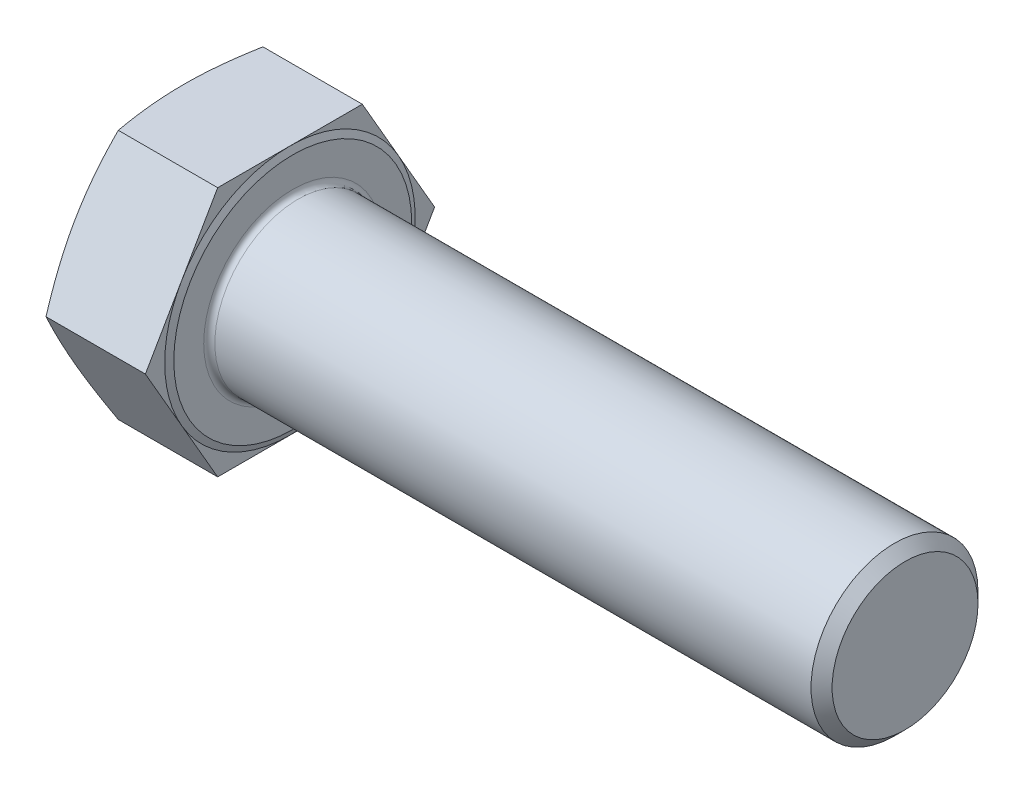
ISO-10303-21;
HEADER;
FILE_DESCRIPTION(('STEP AP214'),'2;1');
FILE_NAME('part.step','',(''),(''),'','','');
FILE_SCHEMA(('AUTOMOTIVE_DESIGN { 1 0 10303 214 1 1 1 1 }'));
ENDSEC;
DATA;
#1=APPLICATION_CONTEXT('core data for automotive mechanical design processes');
#2=APPLICATION_PROTOCOL_DEFINITION('international standard','automotive_design',2000,#1);
#3=PRODUCT_CONTEXT('',#1,'mechanical');
#4=PRODUCT('Part','Part','',(#3));
#5=PRODUCT_RELATED_PRODUCT_CATEGORY('part','',(#4));
#6=PRODUCT_DEFINITION_FORMATION('','',#4);
#7=PRODUCT_DEFINITION_CONTEXT('part definition',#1,'design');
#8=PRODUCT_DEFINITION('design','',#6,#7);
#9=PRODUCT_DEFINITION_SHAPE('','',#8);
#10=(LENGTH_UNIT() NAMED_UNIT(*) SI_UNIT(.MILLI.,.METRE.));
#11=(NAMED_UNIT(*) PLANE_ANGLE_UNIT() SI_UNIT($,.RADIAN.));
#12=(NAMED_UNIT(*) SI_UNIT($,.STERADIAN.) SOLID_ANGLE_UNIT());
#13=UNCERTAINTY_MEASURE_WITH_UNIT(LENGTH_MEASURE(1.E-05),#10,'distance_accuracy_value','');
#14=(GEOMETRIC_REPRESENTATION_CONTEXT(3) GLOBAL_UNCERTAINTY_ASSIGNED_CONTEXT((#13)) GLOBAL_UNIT_ASSIGNED_CONTEXT((#10,
#11,#12)) REPRESENTATION_CONTEXT('',''));
#15=CARTESIAN_POINT('',(0.,0.,0.));
#16=DIRECTION('',(0.,0.,1.));
#17=DIRECTION('',(1.,0.,0.));
#18=AXIS2_PLACEMENT_3D('',#15,#16,#17);
#19=CARTESIAN_POINT('',(19.62,0.,0.));
#20=DIRECTION('',(1.,0.,0.));
#21=DIRECTION('',(0.,0.,-1.));
#22=AXIS2_PLACEMENT_3D('',#19,#20,#21);
#23=PLANE('',#22);
#24=CARTESIAN_POINT('',(19.62,0.,0.));
#25=DIRECTION('',(1.,0.,0.));
#26=DIRECTION('',(0.,0.,-1.));
#27=AXIS2_PLACEMENT_3D('',#24,#25,#26);
#28=CIRCLE('',#27,16.);
#29=CARTESIAN_POINT('',(19.62,0.,-16.));
#30=VERTEX_POINT('',#29);
#31=EDGE_CURVE('E188',#30,#30,#28,.F.);
#32=ORIENTED_EDGE('',*,*,#31,.T.);
#33=EDGE_LOOP('',(#32));
#34=FACE_BOUND('',#33,.T.);
#35=CARTESIAN_POINT('',(19.62,0.,0.));
#36=DIRECTION('',(-1.,0.,0.));
#37=DIRECTION('',(0.,0.,1.));
#38=AXIS2_PLACEMENT_3D('',#35,#36,#37);
#39=CIRCLE('',#38,21.375);
#40=CARTESIAN_POINT('',(19.62,0.,21.375));
#41=VERTEX_POINT('',#40);
#42=EDGE_CURVE('E138',#41,#41,#39,.T.);
#43=ORIENTED_EDGE('',*,*,#42,.F.);
#44=EDGE_LOOP('',(#43));
#45=FACE_BOUND('',#44,.T.);
#46=ADVANCED_FACE('F33',(#34,#45),#23,.T.);
#47=CARTESIAN_POINT('',(19.12,-45.,0.));
#48=DIRECTION('',(-1.,0.,0.));
#49=DIRECTION('',(0.,0.,1.));
#50=AXIS2_PLACEMENT_3D('',#47,#48,#49);
#51=PLANE('',#50);
#52=DIRECTION('',(0.,-0.866025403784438,0.5));
#53=VECTOR('',#52,1.);
#54=CARTESIAN_POINT('',(19.12,22.5,12.9903810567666));
#55=LINE('',#54,#53);
#56=CARTESIAN_POINT('',(19.12,22.5,12.9903810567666));
#57=VERTEX_POINT('',#56);
#58=CARTESIAN_POINT('',(19.12,11.25,19.4855715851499));
#59=VERTEX_POINT('',#58);
#60=EDGE_CURVE('E137',#57,#59,#55,.T.);
#61=ORIENTED_EDGE('',*,*,#60,.T.);
#62=CARTESIAN_POINT('',(19.12,0.,0.));
#63=DIRECTION('',(-1.,0.,0.));
#64=DIRECTION('',(0.,0.,1.));
#65=AXIS2_PLACEMENT_3D('',#62,#63,#64);
#66=CIRCLE('',#65,22.5);
#67=CARTESIAN_POINT('',(19.12,22.5,0.));
#68=VERTEX_POINT('',#67);
#69=EDGE_CURVE('E49',#59,#68,#66,.T.);
#70=ORIENTED_EDGE('',*,*,#69,.T.);
#71=DIRECTION('',(0.,0.,1.));
#72=VECTOR('',#71,1.);
#73=CARTESIAN_POINT('',(19.12,22.5,-12.9903810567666));
#74=LINE('',#73,#72);
#75=EDGE_CURVE('E134',#68,#57,#74,.T.);
#76=ORIENTED_EDGE('',*,*,#75,.T.);
#77=EDGE_LOOP('',(#61,#70,#76));
#78=FACE_BOUND('',#77,.T.);
#79=ADVANCED_FACE('F133',(#78),#51,.F.);
#80=CARTESIAN_POINT('',(19.12,22.5,-12.9903810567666));
#81=VERTEX_POINT('',#80);
#82=EDGE_CURVE('E145',#81,#68,#74,.T.);
#83=ORIENTED_EDGE('',*,*,#82,.T.);
#84=CARTESIAN_POINT('',(19.12,11.25,-19.4855715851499));
#85=VERTEX_POINT('',#84);
#86=EDGE_CURVE('E121',#68,#85,#66,.T.);
#87=ORIENTED_EDGE('',*,*,#86,.T.);
#88=DIRECTION('',(0.,0.866025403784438,0.5));
#89=VECTOR('',#88,1.);
#90=CARTESIAN_POINT('',(19.12,0.,-25.9807621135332));
#91=LINE('',#90,#89);
#92=EDGE_CURVE('E151',#85,#81,#91,.T.);
#93=ORIENTED_EDGE('',*,*,#92,.T.);
#94=EDGE_LOOP('',(#83,#87,#93));
#95=FACE_BOUND('',#94,.T.);
#96=ADVANCED_FACE('F150',(#95),#51,.F.);
#97=CARTESIAN_POINT('',(19.12,0.,-25.9807621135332));
#98=VERTEX_POINT('',#97);
#99=EDGE_CURVE('E148',#98,#85,#91,.T.);
#100=ORIENTED_EDGE('',*,*,#99,.T.);
#101=CARTESIAN_POINT('',(19.12,-11.25,-19.4855715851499));
#102=VERTEX_POINT('',#101);
#103=EDGE_CURVE('E124',#85,#102,#66,.T.);
#104=ORIENTED_EDGE('',*,*,#103,.T.);
#105=DIRECTION('',(0.,0.866025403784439,-0.5));
#106=VECTOR('',#105,1.);
#107=CARTESIAN_POINT('',(19.12,-22.5,-12.9903810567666));
#108=LINE('',#107,#106);
#109=EDGE_CURVE('E348',#102,#98,#108,.T.);
#110=ORIENTED_EDGE('',*,*,#109,.T.);
#111=EDGE_LOOP('',(#100,#104,#110));
#112=FACE_BOUND('',#111,.T.);
#113=ADVANCED_FACE('F302',(#112),#51,.F.);
#114=CARTESIAN_POINT('',(19.12,-22.5,-12.9903810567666));
#115=VERTEX_POINT('',#114);
#116=EDGE_CURVE('E316',#115,#102,#108,.T.);
#117=ORIENTED_EDGE('',*,*,#116,.T.);
#118=CARTESIAN_POINT('',(19.12,-22.5,0.));
#119=VERTEX_POINT('',#118);
#120=EDGE_CURVE('E317',#102,#119,#66,.T.);
#121=ORIENTED_EDGE('',*,*,#120,.T.);
#122=DIRECTION('',(0.,0.,-1.));
#123=VECTOR('',#122,1.);
#124=CARTESIAN_POINT('',(19.12,-22.5,12.9903810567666));
#125=LINE('',#124,#123);
#126=EDGE_CURVE('E162',#119,#115,#125,.T.);
#127=ORIENTED_EDGE('',*,*,#126,.T.);
#128=EDGE_LOOP('',(#117,#121,#127));
#129=FACE_BOUND('',#128,.T.);
#130=ADVANCED_FACE('F295',(#129),#51,.F.);
#131=CARTESIAN_POINT('',(19.12,-22.5,12.9903810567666));
#132=VERTEX_POINT('',#131);
#133=EDGE_CURVE('E163',#132,#119,#125,.T.);
#134=ORIENTED_EDGE('',*,*,#133,.T.);
#135=CARTESIAN_POINT('',(19.12,-11.25,19.4855715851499));
#136=VERTEX_POINT('',#135);
#137=EDGE_CURVE('E306',#119,#136,#66,.T.);
#138=ORIENTED_EDGE('',*,*,#137,.T.);
#139=DIRECTION('',(0.,-0.866025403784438,-0.5));
#140=VECTOR('',#139,1.);
#141=CARTESIAN_POINT('',(19.12,0.,25.9807621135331));
#142=LINE('',#141,#140);
#143=EDGE_CURVE('E158',#136,#132,#142,.T.);
#144=ORIENTED_EDGE('',*,*,#143,.T.);
#145=EDGE_LOOP('',(#134,#138,#144));
#146=FACE_BOUND('',#145,.T.);
#147=ADVANCED_FACE('F287',(#146),#51,.F.);
#148=CARTESIAN_POINT('',(19.12,-22.5,-12.9903810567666));
#149=DIRECTION('',(0.,0.5,0.866025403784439));
#150=DIRECTION('',(0.,-0.866025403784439,0.5));
#151=AXIS2_PLACEMENT_3D('',#148,#149,#150);
#152=PLANE('',#151);
#153=CARTESIAN_POINT('',(1.2669358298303,0.00020000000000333,-25.980877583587));
#154=CARTESIAN_POINT('',(1.16902690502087,-0.465760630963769,-25.7118550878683));
#155=CARTESIAN_POINT('',(1.07552121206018,-0.932406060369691,-25.4424372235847));
#156=CARTESIAN_POINT('',(0.898284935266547,-1.86713009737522,-24.9027740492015));
#157=CARTESIAN_POINT('',(0.814555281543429,-2.33520883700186,-24.6325286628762));
#158=CARTESIAN_POINT('',(0.579402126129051,-3.74220534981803,-23.8201988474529));
#159=CARTESIAN_POINT('',(0.444152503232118,-4.68323927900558,-23.2768926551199));
#160=CARTESIAN_POINT('',(0.279780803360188,-6.09360926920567,-22.4626151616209));
#161=CARTESIAN_POINT('',(0.231546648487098,-6.56131811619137,-22.1925833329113));
#162=CARTESIAN_POINT('',(0.148249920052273,-7.49760906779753,-21.6520154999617));
#163=CARTESIAN_POINT('',(0.113186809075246,-7.96619113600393,-21.3814795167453));
#164=CARTESIAN_POINT('',(0.0568446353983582,-8.90381667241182,-20.8401411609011));
#165=CARTESIAN_POINT('',(0.035560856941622,-9.37285992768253,-20.569338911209));
#166=CARTESIAN_POINT('',(0.00713856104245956,-10.3112687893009,-20.0275483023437));
#167=CARTESIAN_POINT('',(0.,-10.7806343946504,-19.7565599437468));
#168=CARTESIAN_POINT('',(0.,-11.7193656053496,-19.214583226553));
#169=CARTESIAN_POINT('',(0.00713856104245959,-12.1887312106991,-18.943594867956));
#170=CARTESIAN_POINT('',(0.0355608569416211,-13.1271400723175,-18.4018042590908));
#171=CARTESIAN_POINT('',(0.0568446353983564,-13.5961833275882,-18.1310020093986));
#172=CARTESIAN_POINT('',(0.113186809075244,-14.5338088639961,-17.5896636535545));
#173=CARTESIAN_POINT('',(0.148249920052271,-15.0023909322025,-17.3191276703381));
#174=CARTESIAN_POINT('',(0.231546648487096,-15.9386818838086,-16.7785598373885));
#175=CARTESIAN_POINT('',(0.279780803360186,-16.4063907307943,-16.5085280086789));
#176=CARTESIAN_POINT('',(0.444152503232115,-17.8167607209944,-15.6942505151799));
#177=CARTESIAN_POINT('',(0.579402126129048,-18.757794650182,-15.1509443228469));
#178=CARTESIAN_POINT('',(0.814555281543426,-20.1647911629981,-14.3386145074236));
#179=CARTESIAN_POINT('',(0.898284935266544,-20.6328699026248,-14.0683691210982));
#180=CARTESIAN_POINT('',(1.07552121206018,-21.5675939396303,-13.5287059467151));
#181=CARTESIAN_POINT('',(1.16902690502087,-22.0342393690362,-13.2592880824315));
#182=CARTESIAN_POINT('',(1.26693582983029,-22.5002,-12.9902655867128));
#183=B_SPLINE_CURVE_WITH_KNOTS('',3,(#153,#154,#155,#156,#157,#158,#159,#160,#161,#162,#163,
#164,#165,#166,#167,#168,#169,#170,#171,#172,#173,#174,#175,#176,#177,#178,#179,#180,#181,#182),
.UNSPECIFIED.,.F.,.F.,(4,2,2,2,2,2,2,2,2,2,2,2,2,2,4),(0.,1.64059355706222,3.28134307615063,
6.56511024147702,8.19162193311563,9.81806725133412,11.4439556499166,13.0698390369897,
14.6957224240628,16.3216108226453,17.9480561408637,19.5745678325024,22.8583349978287,
24.4990845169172,26.1396780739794),.UNSPECIFIED.);
#184=CARTESIAN_POINT('',(1.26689380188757,0.,-25.9807621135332));
#185=VERTEX_POINT('',#184);
#186=CARTESIAN_POINT('',(0.,-11.25,-19.4855715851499));
#187=VERTEX_POINT('',#186);
#188=EDGE_CURVE('E332',#185,#187,#183,.T.);
#189=ORIENTED_EDGE('',*,*,#188,.F.);
#190=DIRECTION('',(-1.,0.,0.));
#191=VECTOR('',#190,1.);
#192=CARTESIAN_POINT('',(19.12,0.,-25.9807621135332));
#193=LINE('',#192,#191);
#194=EDGE_CURVE('E178',#98,#185,#193,.T.);
#195=ORIENTED_EDGE('',*,*,#194,.F.);
#196=ORIENTED_EDGE('',*,*,#109,.F.);
#197=ORIENTED_EDGE('',*,*,#116,.F.);
#198=DIRECTION('',(-1.,0.,0.));
#199=VECTOR('',#198,1.);
#200=CARTESIAN_POINT('',(19.12,-22.5,-12.9903810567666));
#201=LINE('',#200,#199);
#202=CARTESIAN_POINT('',(1.26689380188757,-22.5,-12.9903810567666));
#203=VERTEX_POINT('',#202);
#204=EDGE_CURVE('E166',#115,#203,#201,.T.);
#205=ORIENTED_EDGE('',*,*,#204,.T.);
#206=EDGE_CURVE('E245',#187,#203,#183,.T.);
#207=ORIENTED_EDGE('',*,*,#206,.F.);
#208=EDGE_LOOP('',(#189,#195,#196,#197,#205,#207));
#209=FACE_BOUND('',#208,.T.);
#210=ADVANCED_FACE('F35',(#209),#152,.F.);
#211=CARTESIAN_POINT('',(19.12,0.,-25.9807621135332));
#212=DIRECTION('',(0.,-0.5,0.866025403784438));
#213=DIRECTION('',(0.,-0.866025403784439,-0.5));
#214=AXIS2_PLACEMENT_3D('',#211,#212,#213);
#215=PLANE('',#214);
#216=CARTESIAN_POINT('',(1.26693582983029,22.5002,-12.9902655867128));
#217=CARTESIAN_POINT('',(1.16902690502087,22.0342393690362,-13.2592880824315));
#218=CARTESIAN_POINT('',(1.07552121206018,21.5675939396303,-13.5287059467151));
#219=CARTESIAN_POINT('',(0.898284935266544,20.6328699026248,-14.0683691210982));
#220=CARTESIAN_POINT('',(0.814555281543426,20.1647911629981,-14.3386145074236));
#221=CARTESIAN_POINT('',(0.579402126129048,18.757794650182,-15.1509443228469));
#222=CARTESIAN_POINT('',(0.444152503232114,17.8167607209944,-15.6942505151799));
#223=CARTESIAN_POINT('',(0.279780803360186,16.4063907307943,-16.5085280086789));
#224=CARTESIAN_POINT('',(0.231546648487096,15.9386818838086,-16.7785598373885));
#225=CARTESIAN_POINT('',(0.148249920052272,15.0023909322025,-17.3191276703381));
#226=CARTESIAN_POINT('',(0.113186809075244,14.5338088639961,-17.5896636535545));
#227=CARTESIAN_POINT('',(0.0568446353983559,13.5961833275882,-18.1310020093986));
#228=CARTESIAN_POINT('',(0.0355608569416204,13.1271400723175,-18.4018042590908));
#229=CARTESIAN_POINT('',(0.00713856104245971,12.1887312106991,-18.943594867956));
#230=CARTESIAN_POINT('',(0.,11.7193656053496,-19.214583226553));
#231=CARTESIAN_POINT('',(0.,10.7806343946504,-19.7565599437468));
#232=CARTESIAN_POINT('',(0.00713856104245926,10.3112687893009,-20.0275483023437));
#233=CARTESIAN_POINT('',(0.0355608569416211,9.37285992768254,-20.569338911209));
#234=CARTESIAN_POINT('',(0.056844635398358,8.90381667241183,-20.8401411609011));
#235=CARTESIAN_POINT('',(0.113186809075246,7.96619113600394,-21.3814795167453));
#236=CARTESIAN_POINT('',(0.148249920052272,7.49760906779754,-21.6520154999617));
#237=CARTESIAN_POINT('',(0.231546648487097,6.56131811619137,-22.1925833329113));
#238=CARTESIAN_POINT('',(0.279780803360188,6.09360926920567,-22.4626151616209));
#239=CARTESIAN_POINT('',(0.444152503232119,4.68323927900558,-23.2768926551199));
#240=CARTESIAN_POINT('',(0.579402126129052,3.74220534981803,-23.8201988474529));
#241=CARTESIAN_POINT('',(0.81455528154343,2.33520883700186,-24.6325286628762));
#242=CARTESIAN_POINT('',(0.898284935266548,1.86713009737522,-24.9027740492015));
#243=CARTESIAN_POINT('',(1.07552121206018,0.932406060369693,-25.4424372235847));
#244=CARTESIAN_POINT('',(1.16902690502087,0.465760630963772,-25.7118550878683));
#245=CARTESIAN_POINT('',(1.2669358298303,-0.000199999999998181,-25.980877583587));
#246=B_SPLINE_CURVE_WITH_KNOTS('',3,(#216,#217,#218,#219,#220,#221,#222,#223,#224,#225,#226,
#227,#228,#229,#230,#231,#232,#233,#234,#235,#236,#237,#238,#239,#240,#241,#242,#243,#244,#245),
.UNSPECIFIED.,.F.,.F.,(4,2,2,2,2,2,2,2,2,2,2,2,2,2,4),(0.,1.64059355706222,3.28134307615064,
6.56511024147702,8.19162193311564,9.81806725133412,11.4439556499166,13.0698390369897,
14.6957224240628,16.3216108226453,17.9480561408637,19.5745678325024,22.8583349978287,
24.4990845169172,26.1396780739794),.UNSPECIFIED.);
#247=CARTESIAN_POINT('',(1.26689380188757,22.5,-12.9903810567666));
#248=VERTEX_POINT('',#247);
#249=CARTESIAN_POINT('',(0.,11.25,-19.4855715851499));
#250=VERTEX_POINT('',#249);
#251=EDGE_CURVE('E260',#248,#250,#246,.T.);
#252=ORIENTED_EDGE('',*,*,#251,.F.);
#253=DIRECTION('',(-1.,0.,0.));
#254=VECTOR('',#253,1.);
#255=CARTESIAN_POINT('',(19.12,22.5,-12.9903810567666));
#256=LINE('',#255,#254);
#257=EDGE_CURVE('E176',#81,#248,#256,.T.);
#258=ORIENTED_EDGE('',*,*,#257,.F.);
#259=ORIENTED_EDGE('',*,*,#92,.F.);
#260=ORIENTED_EDGE('',*,*,#99,.F.);
#261=ORIENTED_EDGE('',*,*,#194,.T.);
#262=EDGE_CURVE('E256',#250,#185,#246,.T.);
#263=ORIENTED_EDGE('',*,*,#262,.F.);
#264=EDGE_LOOP('',(#252,#258,#259,#260,#261,#263));
#265=FACE_BOUND('',#264,.T.);
#266=ADVANCED_FACE('F266',(#265),#215,.F.);
#267=CARTESIAN_POINT('',(19.12,22.5,-12.9903810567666));
#268=DIRECTION('',(0.,-1.,0.));
#269=DIRECTION('',(0.,0.,-1.));
#270=AXIS2_PLACEMENT_3D('',#267,#268,#269);
#271=PLANE('',#270);
#272=CARTESIAN_POINT('',(6.7697780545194,22.5,-34.3939613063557));
#273=CARTESIAN_POINT('',(6.6147526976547,22.5,-33.8849780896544));
#274=CARTESIAN_POINT('',(6.46066486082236,22.5,-33.3757094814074));
#275=CARTESIAN_POINT('',(6.15457411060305,22.5,-32.3565430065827));
#276=CARTESIAN_POINT('',(6.00257120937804,22.5,-31.8466451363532));
#277=CARTESIAN_POINT('',(5.5499851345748,22.5,-30.3158533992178));
#278=CARTESIAN_POINT('',(5.2528475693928,22.5,-29.2939366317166));
#279=CARTESIAN_POINT('',(4.66933339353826,22.5,-27.244966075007));
#280=CARTESIAN_POINT('',(4.3829778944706,22.5,-26.2179062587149));
#281=CARTESIAN_POINT('',(3.82435576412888,22.5,-24.1599665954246));
#282=CARTESIAN_POINT('',(3.55208887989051,22.5,-23.1290868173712));
#283=CARTESIAN_POINT('',(3.02838958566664,22.5,-21.075558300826));
#284=CARTESIAN_POINT('',(2.77674168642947,22.5,-20.0529647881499));
#285=CARTESIAN_POINT('',(2.29487034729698,22.5,-18.0026892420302));
#286=CARTESIAN_POINT('',(2.06464726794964,22.5,-16.9750071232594));
#287=CARTESIAN_POINT('',(1.63099346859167,22.5,-14.9143243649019));
#288=CARTESIAN_POINT('',(1.4275536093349,22.5,-13.8813256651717));
#289=CARTESIAN_POINT('',(1.05366080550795,22.5,-11.8093309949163));
#290=CARTESIAN_POINT('',(0.883206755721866,22.5,-10.7703352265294));
#291=CARTESIAN_POINT('',(0.599087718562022,22.5,-8.80334142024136));
#292=CARTESIAN_POINT('',(0.481198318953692,22.5,-7.87595930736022));
#293=CARTESIAN_POINT('',(0.281639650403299,22.5,-6.01727365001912));
#294=CARTESIAN_POINT('',(0.199969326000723,22.5,-5.0859702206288));
#295=CARTESIAN_POINT('',(0.0767818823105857,22.5,-3.22133095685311));
#296=CARTESIAN_POINT('',(0.0352363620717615,22.5,-2.28799702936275));
#297=CARTESIAN_POINT('',(-0.00559802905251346,22.5,-0.420395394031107));
#298=CARTESIAN_POINT('',(-0.00488719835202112,22.5,0.513872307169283));
#299=CARTESIAN_POINT('',(0.0388631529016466,22.5,2.38614034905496));
#300=CARTESIAN_POINT('',(0.0821173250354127,22.5,3.32413559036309));
#301=CARTESIAN_POINT('',(0.208963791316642,22.5,5.19737094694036));
#302=CARTESIAN_POINT('',(0.292557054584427,22.5,6.13261099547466));
#303=CARTESIAN_POINT('',(0.496171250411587,22.5,7.99987415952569));
#304=CARTESIAN_POINT('',(0.616223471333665,22.5,8.93189381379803));
#305=CARTESIAN_POINT('',(0.887885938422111,22.5,10.791270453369));
#306=CARTESIAN_POINT('',(1.03949635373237,22.5,11.7186274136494));
#307=CARTESIAN_POINT('',(1.37806511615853,22.5,13.6174776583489));
#308=CARTESIAN_POINT('',(1.56646900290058,22.5,14.5887109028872));
#309=CARTESIAN_POINT('',(1.96752546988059,22.5,16.5261898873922));
#310=CARTESIAN_POINT('',(2.18017987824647,22.5,17.4924352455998));
#311=CARTESIAN_POINT('',(2.62527208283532,22.5,19.42062699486));
#312=CARTESIAN_POINT('',(2.85771562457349,22.5,20.3825720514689));
#313=CARTESIAN_POINT('',(3.33860492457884,22.5,22.3024099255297));
#314=CARTESIAN_POINT('',(3.58705029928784,22.5,23.2603028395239));
#315=CARTESIAN_POINT('',(4.09727957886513,22.5,25.1738346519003));
#316=CARTESIAN_POINT('',(4.35908020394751,22.5,26.1294690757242));
#317=CARTESIAN_POINT('',(4.89333122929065,22.5,28.0377523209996));
#318=CARTESIAN_POINT('',(5.16578167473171,22.5,28.9904011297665));
#319=CARTESIAN_POINT('',(5.71938307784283,22.5,30.8929884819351));
#320=CARTESIAN_POINT('',(6.00053256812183,22.5,31.8429274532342));
#321=CARTESIAN_POINT('',(6.57006413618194,22.5,33.7406289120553));
#322=CARTESIAN_POINT('',(6.85844619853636,22.5,34.6883914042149));
#323=CARTESIAN_POINT('',(7.43802103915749,22.5,36.5716051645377));
#324=CARTESIAN_POINT('',(7.72914763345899,22.5,37.5070768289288));
#325=CARTESIAN_POINT('',(8.31635992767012,22.5,39.3764609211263));
#326=CARTESIAN_POINT('',(8.61244562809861,22.5,40.3103733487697));
#327=CARTESIAN_POINT('',(9.20883136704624,22.5,42.1768976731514));
#328=CARTESIAN_POINT('',(9.50913159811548,22.5,43.1095095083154));
#329=CARTESIAN_POINT('',(10.1133153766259,22.5,44.9735719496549));
#330=CARTESIAN_POINT('',(10.4171989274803,22.5,45.9050225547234));
#331=CARTESIAN_POINT('',(11.0268823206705,22.5,47.763380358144));
#332=CARTESIAN_POINT('',(11.3326705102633,22.5,48.6902913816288));
#333=CARTESIAN_POINT('',(11.9468856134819,22.5,50.5432389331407));
#334=CARTESIAN_POINT('',(12.2553125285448,22.5,51.4692754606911));
#335=CARTESIAN_POINT('',(12.8744319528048,22.5,53.3205062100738));
#336=CARTESIAN_POINT('',(13.185124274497,22.5,54.2457004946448));
#337=CARTESIAN_POINT('',(13.8085193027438,22.5,56.0954091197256));
#338=CARTESIAN_POINT('',(14.121222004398,22.5,57.0199234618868));
#339=CARTESIAN_POINT('',(14.4347905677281,22.5,57.9441433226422));
#340=B_SPLINE_CURVE_WITH_KNOTS('',3,(#272,#273,#274,#275,#276,#277,#278,#279,#280,#281,#282,
#283,#284,#285,#286,#287,#288,#289,#290,#291,#292,#293,#294,#295,#296,#297,#298,#299,#300,#301,
#302,#303,#304,#305,#306,#307,#308,#309,#310,#311,#312,#313,#314,#315,#316,#317,#318,#319,#320,
#321,#322,#323,#324,#325,#326,#327,#328,#329,#330,#331,#332,#333,#334,#335,#336,#337,#338,#339),
.UNSPECIFIED.,.F.,.F.,(4,2,2,2,2,2,2,2,2,2,2,2,2,2,2,2,2,2,2,2,2,2,2,2,2,2,2,2,2,2,2,2,2,4),(0.,
1.59620348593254,3.19241627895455,6.3850778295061,9.58369609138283,12.7822569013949,
15.9413811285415,19.100558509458,22.2586550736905,25.4166458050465,28.2205656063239,
31.02440369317,33.8262557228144,36.6280879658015,39.444129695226,42.2602390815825,
45.0787720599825,47.8973201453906,50.8649551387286,53.8328139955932,56.8015374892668,
59.7701898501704,62.7426546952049,65.7151321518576,68.6871109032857,71.6590833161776,
74.5982434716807,77.5374039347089,80.4766991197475,83.4159971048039,86.3441377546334,
89.2722799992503,92.2001825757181,95.1280780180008),.UNSPECIFIED.);
#341=CARTESIAN_POINT('',(1.26689380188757,22.5000000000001,12.9903810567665));
#342=VERTEX_POINT('',#341);
#343=CARTESIAN_POINT('',(0.,22.5,0.));
#344=VERTEX_POINT('',#343);
#345=EDGE_CURVE('E349',#342,#344,#340,.F.);
#346=ORIENTED_EDGE('',*,*,#345,.F.);
#347=DIRECTION('',(-1.,0.,0.));
#348=VECTOR('',#347,1.);
#349=CARTESIAN_POINT('',(19.12,22.5,12.9903810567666));
#350=LINE('',#349,#348);
#351=EDGE_CURVE('E147',#57,#342,#350,.T.);
#352=ORIENTED_EDGE('',*,*,#351,.F.);
#353=ORIENTED_EDGE('',*,*,#75,.F.);
#354=ORIENTED_EDGE('',*,*,#82,.F.);
#355=ORIENTED_EDGE('',*,*,#257,.T.);
#356=EDGE_CURVE('E261',#344,#248,#340,.F.);
#357=ORIENTED_EDGE('',*,*,#356,.F.);
#358=EDGE_LOOP('',(#346,#352,#353,#354,#355,#357));
#359=FACE_BOUND('',#358,.T.);
#360=ADVANCED_FACE('F143',(#359),#271,.F.);
#361=CARTESIAN_POINT('',(19.12,22.5,12.9903810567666));
#362=DIRECTION('',(0.,-0.5,-0.866025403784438));
#363=DIRECTION('',(0.,0.866025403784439,-0.5));
#364=AXIS2_PLACEMENT_3D('',#361,#362,#363);
#365=PLANE('',#364);
#366=CARTESIAN_POINT('',(1.26693582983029,-0.000199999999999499,25.980877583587));
#367=CARTESIAN_POINT('',(1.16902690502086,0.46576063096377,25.7118550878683));
#368=CARTESIAN_POINT('',(1.07552121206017,0.932406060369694,25.4424372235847));
#369=CARTESIAN_POINT('',(0.898284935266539,1.86713009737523,24.9027740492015));
#370=CARTESIAN_POINT('',(0.81455528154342,2.33520883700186,24.6325286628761));
#371=CARTESIAN_POINT('',(0.579402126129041,3.74220534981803,23.8201988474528));
#372=CARTESIAN_POINT('',(0.444152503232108,4.68323927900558,23.2768926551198));
#373=CARTESIAN_POINT('',(0.279780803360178,6.09360926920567,22.4626151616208));
#374=CARTESIAN_POINT('',(0.231546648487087,6.56131811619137,22.1925833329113));
#375=CARTESIAN_POINT('',(0.148249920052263,7.49760906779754,21.6520154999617));
#376=CARTESIAN_POINT('',(0.113186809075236,7.96619113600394,21.3814795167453));
#377=CARTESIAN_POINT('',(0.0568446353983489,8.90381667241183,20.8401411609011));
#378=CARTESIAN_POINT('',(0.0355608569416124,9.37285992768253,20.569338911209));
#379=CARTESIAN_POINT('',(0.00713856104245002,10.3112687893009,20.0275483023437));
#380=CARTESIAN_POINT('',(0.,10.7806343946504,19.7565599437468));
#381=CARTESIAN_POINT('',(0.,11.7193656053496,19.2145832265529));
#382=CARTESIAN_POINT('',(0.00713856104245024,12.1887312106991,18.943594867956));
#383=CARTESIAN_POINT('',(0.0355608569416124,13.1271400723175,18.4018042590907));
#384=CARTESIAN_POINT('',(0.0568446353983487,13.5961833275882,18.1310020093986));
#385=CARTESIAN_POINT('',(0.113186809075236,14.5338088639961,17.5896636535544));
#386=CARTESIAN_POINT('',(0.148249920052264,15.0023909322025,17.319127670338));
#387=CARTESIAN_POINT('',(0.231546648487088,15.9386818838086,16.7785598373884));
#388=CARTESIAN_POINT('',(0.279780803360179,16.4063907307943,16.5085280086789));
#389=CARTESIAN_POINT('',(0.44415250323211,17.8167607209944,15.6942505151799));
#390=CARTESIAN_POINT('',(0.579402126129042,18.757794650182,15.1509443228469));
#391=CARTESIAN_POINT('',(0.814555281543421,20.1647911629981,14.3386145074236));
#392=CARTESIAN_POINT('',(0.89828493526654,20.6328699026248,14.0683691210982));
#393=CARTESIAN_POINT('',(1.07552121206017,21.5675939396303,13.528705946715));
#394=CARTESIAN_POINT('',(1.16902690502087,22.0342393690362,13.2592880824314));
#395=CARTESIAN_POINT('',(1.26693582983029,22.5002,12.9902655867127));
#396=B_SPLINE_CURVE_WITH_KNOTS('',3,(#366,#367,#368,#369,#370,#371,#372,#373,#374,#375,#376,
#377,#378,#379,#380,#381,#382,#383,#384,#385,#386,#387,#388,#389,#390,#391,#392,#393,#394,#395),
.UNSPECIFIED.,.F.,.F.,(4,2,2,2,2,2,2,2,2,2,2,2,2,2,4),(0.,1.64059355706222,3.28134307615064,
6.56511024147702,8.19162193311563,9.81806725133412,11.4439556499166,13.0698390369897,
14.6957224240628,16.3216108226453,17.9480561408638,19.5745678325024,22.8583349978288,
24.4990845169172,26.1396780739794),.UNSPECIFIED.);
#397=CARTESIAN_POINT('',(1.26689380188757,0.,25.9807621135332));
#398=VERTEX_POINT('',#397);
#399=CARTESIAN_POINT('',(0.,11.25,19.4855715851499));
#400=VERTEX_POINT('',#399);
#401=EDGE_CURVE('E250',#398,#400,#396,.T.);
#402=ORIENTED_EDGE('',*,*,#401,.F.);
#403=DIRECTION('',(-1.,0.,0.));
#404=VECTOR('',#403,1.);
#405=CARTESIAN_POINT('',(19.12,0.,25.9807621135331));
#406=LINE('',#405,#404);
#407=CARTESIAN_POINT('',(19.12,0.,25.9807621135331));
#408=VERTEX_POINT('',#407);
#409=EDGE_CURVE('E172',#408,#398,#406,.T.);
#410=ORIENTED_EDGE('',*,*,#409,.F.);
#411=EDGE_CURVE('E153',#59,#408,#55,.T.);
#412=ORIENTED_EDGE('',*,*,#411,.F.);
#413=ORIENTED_EDGE('',*,*,#60,.F.);
#414=ORIENTED_EDGE('',*,*,#351,.T.);
#415=EDGE_CURVE('E335',#400,#342,#396,.T.);
#416=ORIENTED_EDGE('',*,*,#415,.F.);
#417=EDGE_LOOP('',(#402,#410,#412,#413,#414,#416));
#418=FACE_BOUND('',#417,.T.);
#419=ADVANCED_FACE('F272',(#418),#365,.F.);
#420=CARTESIAN_POINT('',(19.12,0.,25.9807621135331));
#421=DIRECTION('',(0.,0.5,-0.866025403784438));
#422=DIRECTION('',(0.,0.866025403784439,0.5));
#423=AXIS2_PLACEMENT_3D('',#420,#421,#422);
#424=PLANE('',#423);
#425=CARTESIAN_POINT('',(1.26693582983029,-22.5002,12.9902655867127));
#426=CARTESIAN_POINT('',(1.16902690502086,-22.0342393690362,13.2592880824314));
#427=CARTESIAN_POINT('',(1.07552121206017,-21.5675939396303,13.528705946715));
#428=CARTESIAN_POINT('',(0.898284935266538,-20.6328699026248,14.0683691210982));
#429=CARTESIAN_POINT('',(0.814555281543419,-20.1647911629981,14.3386145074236));
#430=CARTESIAN_POINT('',(0.579402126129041,-18.757794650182,15.1509443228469));
#431=CARTESIAN_POINT('',(0.444152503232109,-17.8167607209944,15.6942505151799));
#432=CARTESIAN_POINT('',(0.279780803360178,-16.4063907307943,16.5085280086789));
#433=CARTESIAN_POINT('',(0.231546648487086,-15.9386818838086,16.7785598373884));
#434=CARTESIAN_POINT('',(0.148249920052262,-15.0023909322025,17.319127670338));
#435=CARTESIAN_POINT('',(0.113186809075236,-14.5338088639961,17.5896636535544));
#436=CARTESIAN_POINT('',(0.0568446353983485,-13.5961833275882,18.1310020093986));
#437=CARTESIAN_POINT('',(0.0355608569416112,-13.1271400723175,18.4018042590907));
#438=CARTESIAN_POINT('',(0.007138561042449,-12.1887312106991,18.943594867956));
#439=CARTESIAN_POINT('',(0.,-11.7193656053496,19.2145832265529));
#440=CARTESIAN_POINT('',(0.,-10.7806343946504,19.7565599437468));
#441=CARTESIAN_POINT('',(0.00713856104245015,-10.3112687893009,20.0275483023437));
#442=CARTESIAN_POINT('',(0.0355608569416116,-9.37285992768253,20.569338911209));
#443=CARTESIAN_POINT('',(0.0568446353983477,-8.90381667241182,20.8401411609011));
#444=CARTESIAN_POINT('',(0.113186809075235,-7.96619113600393,21.3814795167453));
#445=CARTESIAN_POINT('',(0.148249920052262,-7.49760906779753,21.6520154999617));
#446=CARTESIAN_POINT('',(0.231546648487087,-6.56131811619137,22.1925833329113));
#447=CARTESIAN_POINT('',(0.279780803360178,-6.09360926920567,22.4626151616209));
#448=CARTESIAN_POINT('',(0.44415250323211,-4.68323927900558,23.2768926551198));
#449=CARTESIAN_POINT('',(0.579402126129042,-3.74220534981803,23.8201988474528));
#450=CARTESIAN_POINT('',(0.81455528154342,-2.33520883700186,24.6325286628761));
#451=CARTESIAN_POINT('',(0.898284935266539,-1.86713009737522,24.9027740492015));
#452=CARTESIAN_POINT('',(1.07552121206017,-0.932406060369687,25.4424372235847));
#453=CARTESIAN_POINT('',(1.16902690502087,-0.465760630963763,25.7118550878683));
#454=CARTESIAN_POINT('',(1.26693582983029,0.000200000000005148,25.980877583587));
#455=B_SPLINE_CURVE_WITH_KNOTS('',3,(#425,#426,#427,#428,#429,#430,#431,#432,#433,#434,#435,
#436,#437,#438,#439,#440,#441,#442,#443,#444,#445,#446,#447,#448,#449,#450,#451,#452,#453,#454),
.UNSPECIFIED.,.F.,.F.,(4,2,2,2,2,2,2,2,2,2,2,2,2,2,4),(0.,1.64059355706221,3.28134307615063,
6.56511024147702,8.19162193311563,9.81806725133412,11.4439556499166,13.0698390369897,
14.6957224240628,16.3216108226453,17.9480561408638,19.5745678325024,22.8583349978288,
24.4990845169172,26.1396780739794),.UNSPECIFIED.);
#456=CARTESIAN_POINT('',(1.26689380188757,-22.5,12.9903810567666));
#457=VERTEX_POINT('',#456);
#458=CARTESIAN_POINT('',(0.,-11.25,19.4855715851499));
#459=VERTEX_POINT('',#458);
#460=EDGE_CURVE('E238',#457,#459,#455,.T.);
#461=ORIENTED_EDGE('',*,*,#460,.F.);
#462=DIRECTION('',(-1.,0.,0.));
#463=VECTOR('',#462,1.);
#464=CARTESIAN_POINT('',(19.12,-22.5,12.9903810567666));
#465=LINE('',#464,#463);
#466=EDGE_CURVE('E169',#132,#457,#465,.T.);
#467=ORIENTED_EDGE('',*,*,#466,.F.);
#468=ORIENTED_EDGE('',*,*,#143,.F.);
#469=EDGE_CURVE('E159',#408,#136,#142,.T.);
#470=ORIENTED_EDGE('',*,*,#469,.F.);
#471=ORIENTED_EDGE('',*,*,#409,.T.);
#472=EDGE_CURVE('E330',#459,#398,#455,.T.);
#473=ORIENTED_EDGE('',*,*,#472,.F.);
#474=EDGE_LOOP('',(#461,#467,#468,#470,#471,#473));
#475=FACE_BOUND('',#474,.T.);
#476=ADVANCED_FACE('F275',(#475),#424,.F.);
#477=CARTESIAN_POINT('',(19.12,-22.5,12.9903810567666));
#478=DIRECTION('',(0.,1.,0.));
#479=DIRECTION('',(0.,0.,1.));
#480=AXIS2_PLACEMENT_3D('',#477,#478,#479);
#481=PLANE('',#480);
#482=CARTESIAN_POINT('',(6.76977927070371,-22.5,-34.3939652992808));
#483=CARTESIAN_POINT('',(6.6147538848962,-22.5,-33.8849820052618));
#484=CARTESIAN_POINT('',(6.46066601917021,-22.5,-33.3757133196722));
#485=CARTESIAN_POINT('',(6.15457521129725,-22.5,-32.3565466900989));
#486=CARTESIAN_POINT('',(6.00257228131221,-22.5,-31.8466487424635));
#487=CARTESIAN_POINT('',(5.54998612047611,-22.5,-30.3158567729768));
#488=CARTESIAN_POINT('',(5.2528484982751,-22.5,-29.2939398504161));
#489=CARTESIAN_POINT('',(4.66933420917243,-22.5,-27.2449689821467));
#490=CARTESIAN_POINT('',(4.38297865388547,-22.5,-26.2179090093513));
#491=CARTESIAN_POINT('',(3.82435641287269,-22.5,-24.159969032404));
#492=CARTESIAN_POINT('',(3.55208947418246,-22.5,-23.1290890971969));
#493=CARTESIAN_POINT('',(3.02839007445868,-22.5,-21.0755602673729));
#494=CARTESIAN_POINT('',(2.77674212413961,-22.5,-20.0529665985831));
#495=CARTESIAN_POINT('',(2.29487068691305,-22.5,-18.0026907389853));
#496=CARTESIAN_POINT('',(2.06464756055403,-22.5,-16.97500846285));
#497=CARTESIAN_POINT('',(1.63099367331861,-22.5,-14.9143253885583));
#498=CARTESIAN_POINT('',(1.42755377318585,-22.5,-13.8813265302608));
#499=CARTESIAN_POINT('',(1.05366089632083,-22.5,-11.8093315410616));
#500=CARTESIAN_POINT('',(0.883206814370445,-22.5,-10.7703356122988));
#501=CARTESIAN_POINT('',(0.599087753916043,-22.5,-8.80334168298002));
#502=CARTESIAN_POINT('',(0.4811983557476,-22.5,-7.87595960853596));
#503=CARTESIAN_POINT('',(0.281639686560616,-22.5,-6.01727402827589));
#504=CARTESIAN_POINT('',(0.199969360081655,-22.5,-5.08597063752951));
#505=CARTESIAN_POINT('',(0.0767819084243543,-22.5,-3.22133145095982));
#506=CARTESIAN_POINT('',(0.0352363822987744,-22.5,-2.28799756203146));
#507=CARTESIAN_POINT('',(-0.00559802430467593,-22.5,-0.420396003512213));
#508=CARTESIAN_POINT('',(-0.00488720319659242,-22.5,0.513871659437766));
#509=CARTESIAN_POINT('',(0.0388631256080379,-22.5,2.3861396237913));
#510=CARTESIAN_POINT('',(0.0821172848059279,-22.5,3.32413482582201));
#511=CARTESIAN_POINT('',(0.208963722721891,-22.5,5.19737010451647));
#512=CARTESIAN_POINT('',(0.292556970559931,-22.5,6.13261011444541));
#513=CARTESIAN_POINT('',(0.496171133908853,-22.5,7.9998732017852));
#514=CARTESIAN_POINT('',(0.616223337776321,-22.5,8.93189281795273));
#515=CARTESIAN_POINT('',(0.88788576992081,-22.5,10.7912693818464));
#516=CARTESIAN_POINT('',(1.03949616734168,-22.5,11.7186263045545));
#517=CARTESIAN_POINT('',(1.37806489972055,-22.5,13.6174765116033));
#518=CARTESIAN_POINT('',(1.56646877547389,-22.5,14.5887097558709));
#519=CARTESIAN_POINT('',(1.96752522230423,-22.5,16.526188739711));
#520=CARTESIAN_POINT('',(2.18017962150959,-22.5,17.4924340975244));
#521=CARTESIAN_POINT('',(2.62527180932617,-22.5,19.4206258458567));
#522=CARTESIAN_POINT('',(2.85771534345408,-22.5,20.3825709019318));
#523=CARTESIAN_POINT('',(3.33860462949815,-22.5,22.302408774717));
#524=CARTESIAN_POINT('',(3.58704999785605,-22.5,23.2603016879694));
#525=CARTESIAN_POINT('',(4.09727926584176,-22.5,25.1738334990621));
#526=CARTESIAN_POINT('',(4.35907988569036,-22.5,26.1294679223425));
#527=CARTESIAN_POINT('',(4.89333090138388,-22.5,28.0377511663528));
#528=CARTESIAN_POINT('',(5.16578134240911,-22.5,28.9903999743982));
#529=CARTESIAN_POINT('',(5.71938273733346,-22.5,30.8929873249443));
#530=CARTESIAN_POINT('',(6.00053222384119,-22.5,31.8429262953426));
#531=CARTESIAN_POINT('',(6.57006378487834,-22.5,33.7406277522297));
#532=CARTESIAN_POINT('',(6.85844584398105,-22.5,34.6883902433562));
#533=CARTESIAN_POINT('',(7.4380206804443,-22.5,36.5716040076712));
#534=CARTESIAN_POINT('',(7.72914727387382,-22.5,37.5070756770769));
#535=CARTESIAN_POINT('',(8.31635956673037,-22.5,39.376459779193));
#536=CARTESIAN_POINT('',(8.61244526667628,-22.5,40.3103722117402));
#537=CARTESIAN_POINT('',(9.20883100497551,-22.5,42.1768965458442));
#538=CARTESIAN_POINT('',(9.509131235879,-22.5,43.1095083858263));
#539=CARTESIAN_POINT('',(10.1133150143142,-22.5,44.9735708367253));
#540=CARTESIAN_POINT('',(10.4171985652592,-22.5,45.9050214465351));
#541=CARTESIAN_POINT('',(11.0268819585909,-22.5,47.7633792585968));
#542=CARTESIAN_POINT('',(11.3326701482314,-22.5,48.6902902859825));
#543=CARTESIAN_POINT('',(11.9468852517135,-22.5,50.5432378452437));
#544=CARTESIAN_POINT('',(12.2553121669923,-22.5,51.4692743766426));
#545=CARTESIAN_POINT('',(12.8744315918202,-22.5,53.3205051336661));
#546=CARTESIAN_POINT('',(13.1851239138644,-22.5,54.2456994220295));
#547=CARTESIAN_POINT('',(13.8085189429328,-22.5,56.095408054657));
#548=CARTESIAN_POINT('',(14.1212216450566,-22.5,57.0199224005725));
#549=CARTESIAN_POINT('',(14.4347902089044,-22.5,57.9441422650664));
#550=B_SPLINE_CURVE_WITH_KNOTS('',3,(#482,#483,#484,#485,#486,#487,#488,#489,#490,#491,#492,
#493,#494,#495,#496,#497,#498,#499,#500,#501,#502,#503,#504,#505,#506,#507,#508,#509,#510,#511,
#512,#513,#514,#515,#516,#517,#518,#519,#520,#521,#522,#523,#524,#525,#526,#527,#528,#529,#530,
#531,#532,#533,#534,#535,#536,#537,#538,#539,#540,#541,#542,#543,#544,#545,#546,#547,#548,#549),
.UNSPECIFIED.,.F.,.F.,(4,2,2,2,2,2,2,2,2,2,2,2,2,2,2,2,2,2,2,2,2,2,2,2,2,2,2,2,2,2,2,2,2,4),(0.,
1.59620373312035,3.19241677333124,6.38507881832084,9.58369757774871,12.7822588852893,
15.9413836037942,19.1005614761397,22.258658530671,25.4166497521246,28.2205694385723,
31.0244074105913,33.8262593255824,36.628091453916,39.4441330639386,42.2602423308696,
45.0787751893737,47.8973231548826,50.8649581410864,53.8328169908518,56.8015404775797,
59.7701928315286,62.7426576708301,65.7151351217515,68.6871138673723,71.6590862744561,
74.5982464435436,77.5374069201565,80.4767021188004,83.4160001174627,86.3441407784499,
89.2722830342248,92.2001856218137,95.1280810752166),.UNSPECIFIED.);
#551=CARTESIAN_POINT('',(0.,-22.5,0.));
#552=VERTEX_POINT('',#551);
#553=EDGE_CURVE('E323',#203,#552,#550,.T.);
#554=ORIENTED_EDGE('',*,*,#553,.F.);
#555=ORIENTED_EDGE('',*,*,#204,.F.);
#556=ORIENTED_EDGE('',*,*,#126,.F.);
#557=ORIENTED_EDGE('',*,*,#133,.F.);
#558=ORIENTED_EDGE('',*,*,#466,.T.);
#559=EDGE_CURVE('E228',#552,#457,#550,.T.);
#560=ORIENTED_EDGE('',*,*,#559,.F.);
#561=EDGE_LOOP('',(#554,#555,#556,#557,#558,#560));
#562=FACE_BOUND('',#561,.T.);
#563=ADVANCED_FACE('F279',(#562),#481,.F.);
#564=ORIENTED_EDGE('',*,*,#469,.T.);
#565=EDGE_CURVE('E139',#136,#59,#66,.T.);
#566=ORIENTED_EDGE('',*,*,#565,.T.);
#567=ORIENTED_EDGE('',*,*,#411,.T.);
#568=EDGE_LOOP('',(#564,#566,#567));
#569=FACE_BOUND('',#568,.T.);
#570=ADVANCED_FACE('F213',(#569),#51,.F.);
#571=CARTESIAN_POINT('',(0.,0.,0.));
#572=DIRECTION('',(1.,0.,0.));
#573=DIRECTION('',(0.,0.,-1.));
#574=AXIS2_PLACEMENT_3D('',#571,#572,#573);
#575=CONICAL_SURFACE('',#574,22.5,1.22173047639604);
#576=ORIENTED_EDGE('',*,*,#401,.T.);
#577=CARTESIAN_POINT('',(0.,0.,0.));
#578=DIRECTION('',(-1.,0.,0.));
#579=DIRECTION('',(0.,0.,1.));
#580=AXIS2_PLACEMENT_3D('',#577,#578,#579);
#581=CIRCLE('',#580,22.5);
#582=EDGE_CURVE('E181',#459,#400,#581,.T.);
#583=ORIENTED_EDGE('',*,*,#582,.F.);
#584=ORIENTED_EDGE('',*,*,#472,.T.);
#585=EDGE_LOOP('',(#576,#583,#584));
#586=FACE_BOUND('',#585,.T.);
#587=ADVANCED_FACE('F285',(#586),#575,.T.);
#588=ORIENTED_EDGE('',*,*,#460,.T.);
#589=EDGE_CURVE('E184',#552,#459,#581,.T.);
#590=ORIENTED_EDGE('',*,*,#589,.F.);
#591=ORIENTED_EDGE('',*,*,#559,.T.);
#592=EDGE_LOOP('',(#588,#590,#591));
#593=FACE_BOUND('',#592,.T.);
#594=ADVANCED_FACE('F224',(#593),#575,.T.);
#595=ORIENTED_EDGE('',*,*,#206,.T.);
#596=ORIENTED_EDGE('',*,*,#553,.T.);
#597=EDGE_CURVE('E344',#187,#552,#581,.T.);
#598=ORIENTED_EDGE('',*,*,#597,.F.);
#599=EDGE_LOOP('',(#595,#596,#598));
#600=FACE_BOUND('',#599,.T.);
#601=ADVANCED_FACE('F292',(#600),#575,.T.);
#602=ORIENTED_EDGE('',*,*,#262,.T.);
#603=ORIENTED_EDGE('',*,*,#188,.T.);
#604=EDGE_CURVE('E340',#250,#187,#581,.T.);
#605=ORIENTED_EDGE('',*,*,#604,.F.);
#606=EDGE_LOOP('',(#602,#603,#605));
#607=FACE_BOUND('',#606,.T.);
#608=ADVANCED_FACE('F293',(#607),#575,.T.);
#609=ORIENTED_EDGE('',*,*,#356,.T.);
#610=ORIENTED_EDGE('',*,*,#251,.T.);
#611=EDGE_CURVE('E185',#344,#250,#581,.T.);
#612=ORIENTED_EDGE('',*,*,#611,.F.);
#613=EDGE_LOOP('',(#609,#610,#612));
#614=FACE_BOUND('',#613,.T.);
#615=ADVANCED_FACE('F223',(#614),#575,.T.);
#616=ORIENTED_EDGE('',*,*,#345,.T.);
#617=CARTESIAN_POINT('',(0.,0.,0.));
#618=DIRECTION('',(-1.,0.,0.));
#619=DIRECTION('',(0.,0.,1.));
#620=AXIS2_PLACEMENT_3D('',#617,#618,#619);
#621=CIRCLE('',#620,22.5);
#622=EDGE_CURVE('E57',#400,#344,#621,.T.);
#623=ORIENTED_EDGE('',*,*,#622,.F.);
#624=ORIENTED_EDGE('',*,*,#415,.T.);
#625=EDGE_LOOP('',(#616,#623,#624));
#626=FACE_BOUND('',#625,.T.);
#627=ADVANCED_FACE('F218',(#626),#575,.T.);
#628=CARTESIAN_POINT('',(0.,-45.,0.));
#629=DIRECTION('',(-1.,0.,0.));
#630=DIRECTION('',(0.,0.,1.));
#631=AXIS2_PLACEMENT_3D('',#628,#629,#630);
#632=PLANE('',#631);
#633=ORIENTED_EDGE('',*,*,#582,.T.);
#634=ORIENTED_EDGE('',*,*,#622,.T.);
#635=ORIENTED_EDGE('',*,*,#611,.T.);
#636=ORIENTED_EDGE('',*,*,#604,.T.);
#637=ORIENTED_EDGE('',*,*,#597,.T.);
#638=ORIENTED_EDGE('',*,*,#589,.T.);
#639=EDGE_LOOP('',(#633,#634,#635,#636,#637,#638));
#640=FACE_BOUND('',#639,.T.);
#641=ADVANCED_FACE('F222',(#640),#632,.T.);
#642=CARTESIAN_POINT('',(19.12,0.,0.));
#643=DIRECTION('',(-1.,0.,0.));
#644=DIRECTION('',(0.,0.,1.));
#645=AXIS2_PLACEMENT_3D('',#642,#643,#644);
#646=CONICAL_SURFACE('',#645,22.5,1.15257199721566);
#647=ORIENTED_EDGE('',*,*,#42,.T.);
#648=EDGE_LOOP('',(#647));
#649=FACE_BOUND('',#648,.T.);
#650=ORIENTED_EDGE('',*,*,#69,.F.);
#651=ORIENTED_EDGE('',*,*,#565,.F.);
#652=ORIENTED_EDGE('',*,*,#137,.F.);
#653=ORIENTED_EDGE('',*,*,#120,.F.);
#654=ORIENTED_EDGE('',*,*,#103,.F.);
#655=ORIENTED_EDGE('',*,*,#86,.F.);
#656=EDGE_LOOP('',(#650,#651,#652,#653,#654,#655));
#657=FACE_BOUND('',#656,.T.);
#658=ADVANCED_FACE('F122',(#649,#657),#646,.T.);
#659=CARTESIAN_POINT('',(129.62,0.,0.));
#660=DIRECTION('',(-1.,0.,0.));
#661=DIRECTION('',(0.,0.,1.));
#662=AXIS2_PLACEMENT_3D('',#659,#660,#661);
#663=CYLINDRICAL_SURFACE('',#662,15.);
#664=CARTESIAN_POINT('',(127.7255,0.,0.));
#665=DIRECTION('',(1.,0.,0.));
#666=DIRECTION('',(0.,0.,-1.));
#667=AXIS2_PLACEMENT_3D('',#664,#665,#666);
#668=CIRCLE('',#667,15.);
#669=CARTESIAN_POINT('',(127.7255,0.,-15.));
#670=VERTEX_POINT('',#669);
#671=EDGE_CURVE('E12',#670,#670,#668,.F.);
#672=ORIENTED_EDGE('',*,*,#671,.T.);
#673=EDGE_LOOP('',(#672));
#674=FACE_BOUND('',#673,.T.);
#675=CARTESIAN_POINT('',(20.62,0.,0.));
#676=DIRECTION('',(1.,0.,0.));
#677=DIRECTION('',(0.,0.,-1.));
#678=AXIS2_PLACEMENT_3D('',#675,#676,#677);
#679=CIRCLE('',#678,15.);
#680=CARTESIAN_POINT('',(20.62,0.,-15.));
#681=VERTEX_POINT('',#680);
#682=EDGE_CURVE('E128',#681,#681,#679,.T.);
#683=ORIENTED_EDGE('',*,*,#682,.T.);
#684=EDGE_LOOP('',(#683));
#685=FACE_BOUND('',#684,.T.);
#686=ADVANCED_FACE('F387',(#674,#685),#663,.T.);
#687=CARTESIAN_POINT('',(129.62,0.,0.));
#688=DIRECTION('',(1.,0.,0.));
#689=DIRECTION('',(0.,0.,-1.));
#690=AXIS2_PLACEMENT_3D('',#687,#688,#689);
#691=PLANE('',#690);
#692=CARTESIAN_POINT('',(129.62,0.,0.));
#693=DIRECTION('',(1.,0.,0.));
#694=DIRECTION('',(0.,0.,-1.));
#695=AXIS2_PLACEMENT_3D('',#692,#693,#694);
#696=CIRCLE('',#695,13.1055);
#697=CARTESIAN_POINT('',(129.62,0.,-13.1055));
#698=VERTEX_POINT('',#697);
#699=EDGE_CURVE('E42',#698,#698,#696,.T.);
#700=ORIENTED_EDGE('',*,*,#699,.T.);
#701=EDGE_LOOP('',(#700));
#702=FACE_BOUND('',#701,.T.);
#703=ADVANCED_FACE('F193',(#702),#691,.T.);
#704=CARTESIAN_POINT('',(20.62,0.,0.));
#705=DIRECTION('',(1.,0.,0.));
#706=DIRECTION('',(0.,0.,-1.));
#707=AXIS2_PLACEMENT_3D('',#704,#705,#706);
#708=TOROIDAL_SURFACE('',#707,16.,1.);
#709=ORIENTED_EDGE('',*,*,#31,.F.);
#710=EDGE_LOOP('',(#709));
#711=FACE_BOUND('',#710,.T.);
#712=ORIENTED_EDGE('',*,*,#682,.F.);
#713=EDGE_LOOP('',(#712));
#714=FACE_BOUND('',#713,.T.);
#715=ADVANCED_FACE('F197',(#711,#714),#708,.F.);
#716=CARTESIAN_POINT('',(129.62,0.,0.));
#717=DIRECTION('',(-1.,0.,0.));
#718=DIRECTION('',(0.,0.,1.));
#719=AXIS2_PLACEMENT_3D('',#716,#717,#718);
#720=CONICAL_SURFACE('',#719,13.1055,0.785398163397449);
#721=ORIENTED_EDGE('',*,*,#671,.F.);
#722=EDGE_LOOP('',(#721));
#723=FACE_BOUND('',#722,.T.);
#724=ORIENTED_EDGE('',*,*,#699,.F.);
#725=EDGE_LOOP('',(#724));
#726=FACE_BOUND('',#725,.T.);
#727=ADVANCED_FACE('F195',(#723,#726),#720,.T.);
#728=CLOSED_SHELL('',(#46,#79,#96,#113,#130,#147,#210,#266,#360,#419,#476,#563,#570,#587,#594,
#601,#608,#615,#627,#641,#658,#686,#703,#715,#727));
#729=MANIFOLD_SOLID_BREP('B2',#728);
#730=ADVANCED_BREP_SHAPE_REPRESENTATION('',(#18,#729),#14);
#731=SHAPE_DEFINITION_REPRESENTATION(#9,#730);
ENDSEC;
END-ISO-10303-21;
